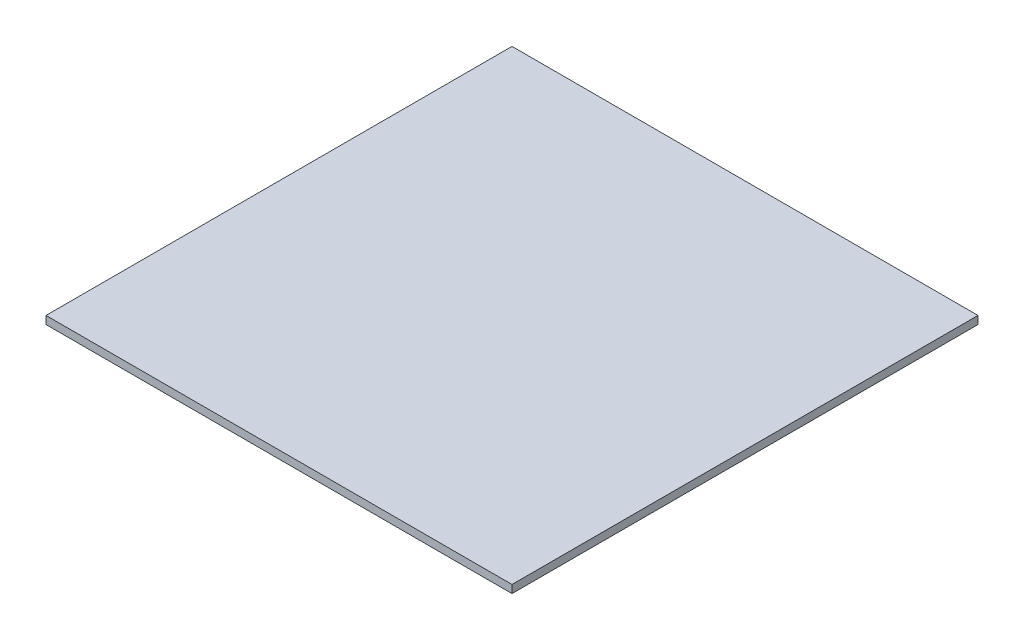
from build123d import *

# Parameters (mm, degrees)
SKETCH1_W           = 10
SKETCH1_H           = 10
BOSS_EXTRUDE1_DEPTH = 0.17


with BuildPart() as part:
    # Sketch1 → Boss-Extrude1 (new body)
    with BuildSketch(Plane(origin=(0, 0, 0), x_dir=(1, 0, 0), z_dir=(0, 1, 0))):
        Rectangle(SKETCH1_W, SKETCH1_H)
    extrude(amount=BOSS_EXTRUDE1_DEPTH)


solid = part.part
